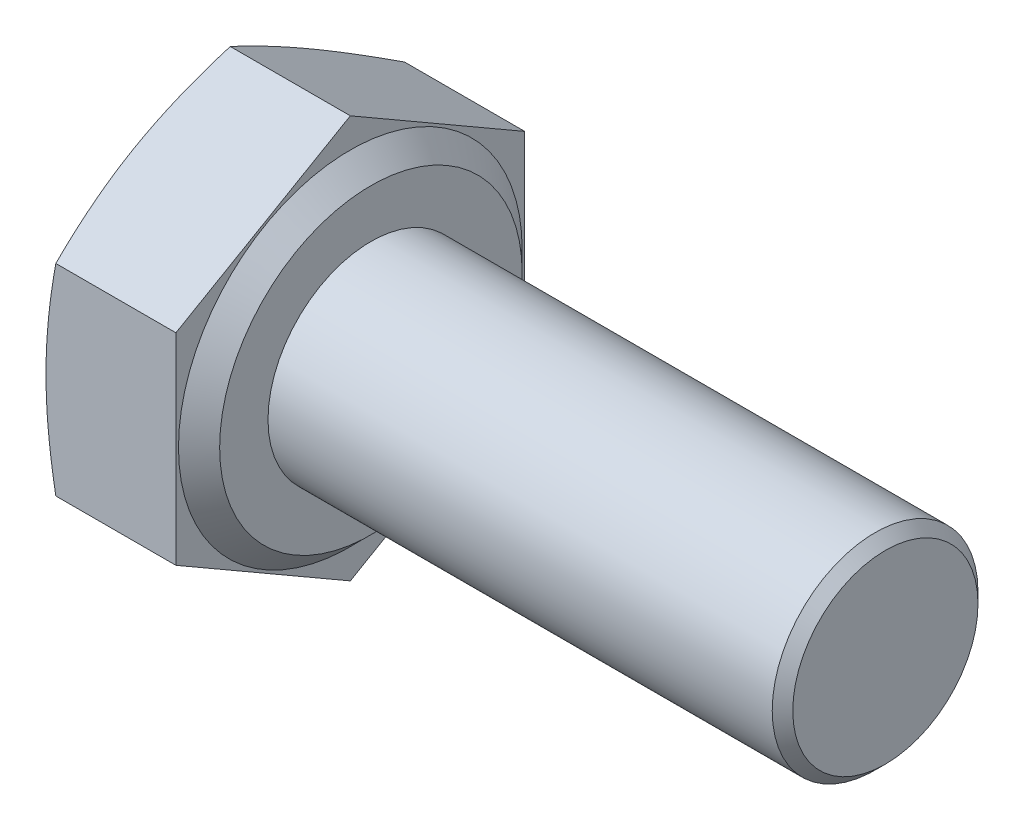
ISO-10303-21;
HEADER;
FILE_DESCRIPTION(('STEP AP214'),'2;1');
FILE_NAME('part.step','',(''),(''),'','','');
FILE_SCHEMA(('AUTOMOTIVE_DESIGN { 1 0 10303 214 1 1 1 1 }'));
ENDSEC;
DATA;
#1=APPLICATION_CONTEXT('core data for automotive mechanical design processes');
#2=APPLICATION_PROTOCOL_DEFINITION('international standard','automotive_design',2000,#1);
#3=PRODUCT_CONTEXT('',#1,'mechanical');
#4=PRODUCT('Part','Part','',(#3));
#5=PRODUCT_RELATED_PRODUCT_CATEGORY('part','',(#4));
#6=PRODUCT_DEFINITION_FORMATION('','',#4);
#7=PRODUCT_DEFINITION_CONTEXT('part definition',#1,'design');
#8=PRODUCT_DEFINITION('design','',#6,#7);
#9=PRODUCT_DEFINITION_SHAPE('','',#8);
#10=(LENGTH_UNIT() NAMED_UNIT(*) SI_UNIT(.MILLI.,.METRE.));
#11=(NAMED_UNIT(*) PLANE_ANGLE_UNIT() SI_UNIT($,.RADIAN.));
#12=(NAMED_UNIT(*) SI_UNIT($,.STERADIAN.) SOLID_ANGLE_UNIT());
#13=UNCERTAINTY_MEASURE_WITH_UNIT(LENGTH_MEASURE(1.E-05),#10,'distance_accuracy_value','');
#14=(GEOMETRIC_REPRESENTATION_CONTEXT(3) GLOBAL_UNCERTAINTY_ASSIGNED_CONTEXT((#13)) GLOBAL_UNIT_ASSIGNED_CONTEXT((#10,
#11,#12)) REPRESENTATION_CONTEXT('',''));
#15=CARTESIAN_POINT('',(0.,0.,0.));
#16=DIRECTION('',(0.,0.,1.));
#17=DIRECTION('',(1.,0.,0.));
#18=AXIS2_PLACEMENT_3D('',#15,#16,#17);
#19=CARTESIAN_POINT('',(2.925,-1.95721741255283,-3.39));
#20=DIRECTION('',(1.,0.,0.));
#21=DIRECTION('',(0.,0.,-1.));
#22=AXIS2_PLACEMENT_3D('',#19,#20,#21);
#23=PLANE('',#22);
#24=CARTESIAN_POINT('',(2.925,0.,0.));
#25=DIRECTION('',(-1.,0.,0.));
#26=DIRECTION('',(0.,0.,1.));
#27=AXIS2_PLACEMENT_3D('',#24,#25,#26);
#28=CIRCLE('',#27,2.94);
#29=CARTESIAN_POINT('',(2.925,0.,2.94));
#30=VERTEX_POINT('',#29);
#31=EDGE_CURVE('E260',#30,#30,#28,.T.);
#32=ORIENTED_EDGE('',*,*,#31,.F.);
#33=EDGE_LOOP('',(#32));
#34=FACE_BOUND('',#33,.T.);
#35=CARTESIAN_POINT('',(2.925,0.,0.));
#36=DIRECTION('',(1.,0.,0.));
#37=DIRECTION('',(0.,0.,-1.));
#38=AXIS2_PLACEMENT_3D('',#35,#36,#37);
#39=CIRCLE('',#38,2.);
#40=CARTESIAN_POINT('',(2.925,0.,-2.));
#41=VERTEX_POINT('',#40);
#42=EDGE_CURVE('E282',#41,#41,#39,.T.);
#43=ORIENTED_EDGE('',*,*,#42,.F.);
#44=EDGE_LOOP('',(#43));
#45=FACE_BOUND('',#44,.T.);
#46=ADVANCED_FACE('F30',(#34,#45),#23,.T.);
#47=CARTESIAN_POINT('',(2.925,-3.91443482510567,0.));
#48=DIRECTION('',(0.,0.866025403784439,0.5));
#49=DIRECTION('',(0.,-0.5,0.866025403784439));
#50=AXIS2_PLACEMENT_3D('',#47,#48,#49);
#51=PLANE('',#50);
#52=CARTESIAN_POINT('',(0.190920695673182,-1.957101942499,-3.3902));
#53=CARTESIAN_POINT('',(0.161404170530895,-2.03816412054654,-3.24979618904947));
#54=CARTESIAN_POINT('',(0.134553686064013,-2.11949362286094,-3.10892935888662));
#55=CARTESIAN_POINT('',(0.0873142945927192,-2.28268148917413,-2.82627968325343));
#56=CARTESIAN_POINT('',(0.0669304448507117,-2.36454021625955,-2.68449620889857));
#57=CARTESIAN_POINT('',(0.0339601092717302,-2.52787800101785,-2.40158686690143));
#58=CARTESIAN_POINT('',(0.0213017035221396,-2.6093533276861,-2.26046746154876));
#59=CARTESIAN_POINT('',(0.00432321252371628,-2.77249453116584,-1.97789860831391));
#60=CARTESIAN_POINT('',(0.,-2.85416032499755,-1.83644930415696));
#61=CARTESIAN_POINT('',(0.,-3.01749191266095,-1.55355069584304));
#62=CARTESIAN_POINT('',(0.00432321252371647,-3.09915770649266,-1.41210139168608));
#63=CARTESIAN_POINT('',(0.0213017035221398,-3.2622989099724,-1.12953253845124));
#64=CARTESIAN_POINT('',(0.0339601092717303,-3.34377423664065,-0.988413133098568));
#65=CARTESIAN_POINT('',(0.066930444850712,-3.50711202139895,-0.705503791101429));
#66=CARTESIAN_POINT('',(0.0873142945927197,-3.58897074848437,-0.563720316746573));
#67=CARTESIAN_POINT('',(0.134553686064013,-3.75215861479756,-0.281070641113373));
#68=CARTESIAN_POINT('',(0.161404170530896,-3.83348811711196,-0.140203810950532));
#69=CARTESIAN_POINT('',(0.190920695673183,-3.9145502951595,0.000200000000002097));
#70=B_SPLINE_CURVE_WITH_KNOTS('',3,(#52,#53,#54,#55,#56,#57,#58,#59,#60,#61,#62,#63,#64,#65,#66,
#67,#68,#69),.UNSPECIFIED.,.F.,.F.,(4,2,2,2,2,2,2,2,4),(0.,0.494419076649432,0.98922386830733,
1.47934907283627,1.96929035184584,2.45923163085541,2.94935683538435,3.44416162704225,
3.93858070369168),.UNSPECIFIED.);
#71=CARTESIAN_POINT('',(0.190878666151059,-1.95721741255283,-3.39));
#72=VERTEX_POINT('',#71);
#73=CARTESIAN_POINT('',(0.,-2.93582611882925,-1.695));
#74=VERTEX_POINT('',#73);
#75=EDGE_CURVE('E108',#72,#74,#70,.T.);
#76=ORIENTED_EDGE('',*,*,#75,.F.);
#77=DIRECTION('',(-1.,0.,0.));
#78=VECTOR('',#77,1.);
#79=CARTESIAN_POINT('',(2.925,-1.95721741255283,-3.39));
#80=LINE('',#79,#78);
#81=CARTESIAN_POINT('',(2.525,-1.95721741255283,-3.39));
#82=VERTEX_POINT('',#81);
#83=EDGE_CURVE('E137',#82,#72,#80,.T.);
#84=ORIENTED_EDGE('',*,*,#83,.F.);
#85=DIRECTION('',(0.,0.5,-0.866025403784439));
#86=VECTOR('',#85,1.);
#87=CARTESIAN_POINT('',(2.525,-3.91443482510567,0.));
#88=LINE('',#87,#86);
#89=CARTESIAN_POINT('',(2.525,-3.91443482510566,0.));
#90=VERTEX_POINT('',#89);
#91=EDGE_CURVE('E273',#90,#82,#88,.T.);
#92=ORIENTED_EDGE('',*,*,#91,.F.);
#93=DIRECTION('',(-1.,0.,0.));
#94=VECTOR('',#93,1.);
#95=CARTESIAN_POINT('',(2.925,-3.91443482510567,0.));
#96=LINE('',#95,#94);
#97=CARTESIAN_POINT('',(0.190878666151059,-3.91443482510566,0.));
#98=VERTEX_POINT('',#97);
#99=EDGE_CURVE('E131',#90,#98,#96,.T.);
#100=ORIENTED_EDGE('',*,*,#99,.T.);
#101=EDGE_CURVE('E161',#74,#98,#70,.T.);
#102=ORIENTED_EDGE('',*,*,#101,.F.);
#103=EDGE_LOOP('',(#76,#84,#92,#100,#102));
#104=FACE_BOUND('',#103,.T.);
#105=ADVANCED_FACE('F176',(#104),#51,.F.);
#106=CARTESIAN_POINT('',(2.925,-1.95721741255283,-3.39));
#107=DIRECTION('',(0.,0.,1.));
#108=DIRECTION('',(0.,-1.,0.));
#109=AXIS2_PLACEMENT_3D('',#106,#107,#108);
#110=PLANE('',#109);
#111=CARTESIAN_POINT('',(1.01998007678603,-5.18202410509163,-3.39));
#112=CARTESIAN_POINT('',(0.973277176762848,-5.02864822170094,-3.39));
#113=CARTESIAN_POINT('',(0.927119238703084,-4.87510331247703,-3.39));
#114=CARTESIAN_POINT('',(0.836194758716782,-4.56758939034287,-3.39));
#115=CARTESIAN_POINT('',(0.791428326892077,-4.41362034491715,-3.39));
#116=CARTESIAN_POINT('',(0.703513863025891,-4.10490856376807,-3.39));
#117=CARTESIAN_POINT('',(0.660369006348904,-3.95016492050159,-3.39));
#118=CARTESIAN_POINT('',(0.576202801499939,-3.64010200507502,-3.39));
#119=CARTESIAN_POINT('',(0.535181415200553,-3.484782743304,-3.39));
#120=CARTESIAN_POINT('',(0.456277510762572,-3.17538445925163,-3.39));
#121=CARTESIAN_POINT('',(0.418362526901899,-3.02131375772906,-3.39));
#122=CARTESIAN_POINT('',(0.345760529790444,-2.71240553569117,-3.39));
#123=CARTESIAN_POINT('',(0.311073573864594,-2.55756800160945,-3.39));
#124=CARTESIAN_POINT('',(0.24573675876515,-2.24709346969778,-3.39));
#125=CARTESIAN_POINT('',(0.215085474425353,-2.09145677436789,-3.39));
#126=CARTESIAN_POINT('',(0.158752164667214,-1.77927622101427,-3.39));
#127=CARTESIAN_POINT('',(0.133070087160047,-1.62273237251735,-3.39));
#128=CARTESIAN_POINT('',(0.0902615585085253,-1.3263632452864,-3.39));
#129=CARTESIAN_POINT('',(0.0724987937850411,-1.186630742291,-3.39));
#130=CARTESIAN_POINT('',(0.0424324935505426,-0.906588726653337,-3.39));
#131=CARTESIAN_POINT('',(0.0301282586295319,-0.766279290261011,-3.39));
#132=CARTESIAN_POINT('',(0.0115684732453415,-0.485347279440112,-3.39));
#133=CARTESIAN_POINT('',(0.00530894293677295,-0.344724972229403,-3.39));
#134=CARTESIAN_POINT('',(-0.00084342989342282,-0.0633396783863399,-3.39));
#135=CARTESIAN_POINT('',(-0.000736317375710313,0.0774233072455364,-3.39));
#136=CARTESIAN_POINT('',(0.00585535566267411,0.359511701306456,-3.39));
#137=CARTESIAN_POINT('',(0.0123722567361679,0.500836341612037,-3.39));
#138=CARTESIAN_POINT('',(0.0314839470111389,0.783070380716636,-3.39));
#139=CARTESIAN_POINT('',(0.0440788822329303,0.923979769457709,-3.39));
#140=CARTESIAN_POINT('',(0.0747561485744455,1.20531436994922,-3.39));
#141=CARTESIAN_POINT('',(0.0928431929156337,1.34573906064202,-3.39));
#142=CARTESIAN_POINT('',(0.133775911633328,1.62588403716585,-3.39));
#143=CARTESIAN_POINT('',(0.156621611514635,1.76560431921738,-3.39));
#144=CARTESIAN_POINT('',(0.233780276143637,2.19842514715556,-3.39));
#145=CARTESIAN_POINT('',(0.294955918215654,2.4902988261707,-3.39));
#146=CARTESIAN_POINT('',(0.429080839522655,3.07133562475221,-3.39));
#147=CARTESIAN_POINT('',(0.502034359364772,3.36049772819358,-3.39));
#148=CARTESIAN_POINT('',(0.65579023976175,3.93710818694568,-3.39));
#149=CARTESIAN_POINT('',(0.736602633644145,4.22455384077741,-3.39));
#150=CARTESIAN_POINT('',(0.90342621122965,4.79786777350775,-3.39));
#151=CARTESIAN_POINT('',(0.989436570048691,5.0837362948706,-3.39));
#152=CARTESIAN_POINT('',(1.16408502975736,5.65121198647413,-3.39));
#153=CARTESIAN_POINT('',(1.25268364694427,5.93283136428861,-3.39));
#154=CARTESIAN_POINT('',(1.43239750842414,6.49527820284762,-3.39));
#155=CARTESIAN_POINT('',(1.52351287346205,6.77610562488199,-3.39));
#156=CARTESIAN_POINT('',(1.70722880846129,7.33609271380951,-3.39));
#157=CARTESIAN_POINT('',(1.7998224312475,7.61525466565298,-3.39));
#158=CARTESIAN_POINT('',(1.98639796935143,8.17308908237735,-3.39));
#159=CARTESIAN_POINT('',(2.08037976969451,8.45176158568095,-3.39));
#160=CARTESIAN_POINT('',(2.17484722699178,8.73026698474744,-3.39));
#161=B_SPLINE_CURVE_WITH_KNOTS('',3,(#111,#112,#113,#114,#115,#116,#117,#118,#119,#120,#121,
#122,#123,#124,#125,#126,#127,#128,#129,#130,#131,#132,#133,#134,#135,#136,#137,#138,#139,#140,
#141,#142,#143,#144,#145,#146,#147,#148,#149,#150,#151,#152,#153,#154,#155,#156,#157,#158,#159,
#160),.UNSPECIFIED.,.F.,.F.,(4,2,2,2,2,2,2,2,2,2,2,2,2,2,2,2,2,2,2,2,2,2,2,2,4),(0.,
0.480989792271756,0.962017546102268,1.44394277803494,1.92585935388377,2.40183391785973,
2.87781693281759,3.35363140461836,3.82944088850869,4.25191903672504,4.6743430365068,
5.09648872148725,5.5186314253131,5.94291503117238,6.36720883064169,6.79186778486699,
7.2165290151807,8.11074158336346,9.00527683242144,9.90096950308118,10.7965204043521,
11.6821863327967,12.5678948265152,13.4502426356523,14.3325177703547),.UNSPECIFIED.);
#162=CARTESIAN_POINT('',(0.190878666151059,1.95721741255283,-3.39));
#163=VERTEX_POINT('',#162);
#164=CARTESIAN_POINT('',(0.,0.,-3.39));
#165=VERTEX_POINT('',#164);
#166=EDGE_CURVE('E221',#163,#165,#161,.F.);
#167=ORIENTED_EDGE('',*,*,#166,.F.);
#168=DIRECTION('',(-1.,0.,0.));
#169=VECTOR('',#168,1.);
#170=CARTESIAN_POINT('',(2.925,1.95721741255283,-3.39));
#171=LINE('',#170,#169);
#172=CARTESIAN_POINT('',(2.525,1.95721741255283,-3.39));
#173=VERTEX_POINT('',#172);
#174=EDGE_CURVE('E128',#173,#163,#171,.T.);
#175=ORIENTED_EDGE('',*,*,#174,.F.);
#176=DIRECTION('',(0.,1.,0.));
#177=VECTOR('',#176,1.);
#178=CARTESIAN_POINT('',(2.525,-1.95721741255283,-3.39));
#179=LINE('',#178,#177);
#180=EDGE_CURVE('E271',#82,#173,#179,.T.);
#181=ORIENTED_EDGE('',*,*,#180,.F.);
#182=ORIENTED_EDGE('',*,*,#83,.T.);
#183=EDGE_CURVE('E119',#165,#72,#161,.F.);
#184=ORIENTED_EDGE('',*,*,#183,.F.);
#185=EDGE_LOOP('',(#167,#175,#181,#182,#184));
#186=FACE_BOUND('',#185,.T.);
#187=ADVANCED_FACE('F228',(#186),#110,.F.);
#188=CARTESIAN_POINT('',(2.925,1.95721741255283,-3.39));
#189=DIRECTION('',(0.,-0.866025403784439,0.5));
#190=DIRECTION('',(0.,-0.5,-0.866025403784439));
#191=AXIS2_PLACEMENT_3D('',#188,#189,#190);
#192=PLANE('',#191);
#193=CARTESIAN_POINT('',(0.190920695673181,3.9145502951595,0.000199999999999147));
#194=CARTESIAN_POINT('',(0.161404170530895,3.83348811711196,-0.140203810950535));
#195=CARTESIAN_POINT('',(0.134553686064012,3.75215861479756,-0.281070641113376));
#196=CARTESIAN_POINT('',(0.0873142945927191,3.58897074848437,-0.563720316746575));
#197=CARTESIAN_POINT('',(0.0669304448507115,3.50711202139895,-0.705503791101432));
#198=CARTESIAN_POINT('',(0.0339601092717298,3.34377423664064,-0.988413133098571));
#199=CARTESIAN_POINT('',(0.0213017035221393,3.2622989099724,-1.12953253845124));
#200=CARTESIAN_POINT('',(0.004323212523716,3.09915770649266,-1.41210139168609));
#201=CARTESIAN_POINT('',(0.,3.01749191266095,-1.55355069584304));
#202=CARTESIAN_POINT('',(0.,2.85416032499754,-1.83644930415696));
#203=CARTESIAN_POINT('',(0.00432321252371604,2.77249453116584,-1.97789860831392));
#204=CARTESIAN_POINT('',(0.0213017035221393,2.6093533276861,-2.26046746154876));
#205=CARTESIAN_POINT('',(0.0339601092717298,2.52787800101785,-2.40158686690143));
#206=CARTESIAN_POINT('',(0.0669304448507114,2.36454021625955,-2.68449620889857));
#207=CARTESIAN_POINT('',(0.087314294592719,2.28268148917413,-2.82627968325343));
#208=CARTESIAN_POINT('',(0.134553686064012,2.11949362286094,-3.10892935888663));
#209=CARTESIAN_POINT('',(0.161404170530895,2.03816412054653,-3.24979618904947));
#210=CARTESIAN_POINT('',(0.190920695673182,1.95710194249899,-3.3902));
#211=B_SPLINE_CURVE_WITH_KNOTS('',3,(#193,#194,#195,#196,#197,#198,#199,#200,#201,#202,#203,
#204,#205,#206,#207,#208,#209,#210),.UNSPECIFIED.,.F.,.F.,(4,2,2,2,2,2,2,2,4),(0.,
0.494419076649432,0.989223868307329,1.47934907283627,1.96929035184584,2.45923163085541,
2.94935683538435,3.44416162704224,3.93858070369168),.UNSPECIFIED.);
#212=CARTESIAN_POINT('',(0.190878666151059,3.91443482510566,0.));
#213=VERTEX_POINT('',#212);
#214=CARTESIAN_POINT('',(0.,2.93582611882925,-1.695));
#215=VERTEX_POINT('',#214);
#216=EDGE_CURVE('E45',#213,#215,#211,.T.);
#217=ORIENTED_EDGE('',*,*,#216,.F.);
#218=DIRECTION('',(-1.,0.,0.));
#219=VECTOR('',#218,1.);
#220=CARTESIAN_POINT('',(2.925,3.91443482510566,0.));
#221=LINE('',#220,#219);
#222=CARTESIAN_POINT('',(2.525,3.91443482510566,0.));
#223=VERTEX_POINT('',#222);
#224=EDGE_CURVE('E125',#223,#213,#221,.T.);
#225=ORIENTED_EDGE('',*,*,#224,.F.);
#226=DIRECTION('',(0.,0.5,0.866025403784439));
#227=VECTOR('',#226,1.);
#228=CARTESIAN_POINT('',(2.525,1.95721741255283,-3.39));
#229=LINE('',#228,#227);
#230=EDGE_CURVE('E269',#173,#223,#229,.T.);
#231=ORIENTED_EDGE('',*,*,#230,.F.);
#232=ORIENTED_EDGE('',*,*,#174,.T.);
#233=EDGE_CURVE('E222',#215,#163,#211,.T.);
#234=ORIENTED_EDGE('',*,*,#233,.F.);
#235=EDGE_LOOP('',(#217,#225,#231,#232,#234));
#236=FACE_BOUND('',#235,.T.);
#237=ADVANCED_FACE('F231',(#236),#192,.F.);
#238=CARTESIAN_POINT('',(2.925,3.91443482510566,0.));
#239=DIRECTION('',(0.,-0.866025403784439,-0.5));
#240=DIRECTION('',(0.,0.5,-0.866025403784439));
#241=AXIS2_PLACEMENT_3D('',#238,#239,#240);
#242=PLANE('',#241);
#243=CARTESIAN_POINT('',(0.190920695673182,1.95710194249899,3.3902));
#244=CARTESIAN_POINT('',(0.161404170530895,2.03816412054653,3.24979618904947));
#245=CARTESIAN_POINT('',(0.134553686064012,2.11949362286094,3.10892935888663));
#246=CARTESIAN_POINT('',(0.0873142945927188,2.28268148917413,2.82627968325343));
#247=CARTESIAN_POINT('',(0.0669304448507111,2.36454021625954,2.68449620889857));
#248=CARTESIAN_POINT('',(0.0339601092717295,2.52787800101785,2.40158686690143));
#249=CARTESIAN_POINT('',(0.0213017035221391,2.6093533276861,2.26046746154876));
#250=CARTESIAN_POINT('',(0.00432321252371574,2.77249453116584,1.97789860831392));
#251=CARTESIAN_POINT('',(0.,2.85416032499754,1.83644930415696));
#252=CARTESIAN_POINT('',(0.,3.01749191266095,1.55355069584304));
#253=CARTESIAN_POINT('',(0.00432321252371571,3.09915770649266,1.41210139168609));
#254=CARTESIAN_POINT('',(0.0213017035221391,3.2622989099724,1.12953253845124));
#255=CARTESIAN_POINT('',(0.0339601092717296,3.34377423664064,0.98841313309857));
#256=CARTESIAN_POINT('',(0.0669304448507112,3.50711202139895,0.705503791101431));
#257=CARTESIAN_POINT('',(0.0873142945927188,3.58897074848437,0.563720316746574));
#258=CARTESIAN_POINT('',(0.134553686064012,3.75215861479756,0.281070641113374));
#259=CARTESIAN_POINT('',(0.161404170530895,3.83348811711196,0.140203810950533));
#260=CARTESIAN_POINT('',(0.190920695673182,3.9145502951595,-0.000200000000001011));
#261=B_SPLINE_CURVE_WITH_KNOTS('',3,(#243,#244,#245,#246,#247,#248,#249,#250,#251,#252,#253,
#254,#255,#256,#257,#258,#259,#260),.UNSPECIFIED.,.F.,.F.,(4,2,2,2,2,2,2,2,4),(0.,
0.494419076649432,0.98922386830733,1.47934907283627,1.96929035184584,2.45923163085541,
2.94935683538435,3.44416162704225,3.93858070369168),.UNSPECIFIED.);
#262=CARTESIAN_POINT('',(0.190878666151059,1.95721741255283,3.39));
#263=VERTEX_POINT('',#262);
#264=CARTESIAN_POINT('',(0.,2.93582611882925,1.695));
#265=VERTEX_POINT('',#264);
#266=EDGE_CURVE('E53',#263,#265,#261,.T.);
#267=ORIENTED_EDGE('',*,*,#266,.F.);
#268=DIRECTION('',(-1.,0.,0.));
#269=VECTOR('',#268,1.);
#270=CARTESIAN_POINT('',(2.925,1.95721741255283,3.39));
#271=LINE('',#270,#269);
#272=CARTESIAN_POINT('',(2.525,1.95721741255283,3.39));
#273=VERTEX_POINT('',#272);
#274=EDGE_CURVE('E116',#273,#263,#271,.T.);
#275=ORIENTED_EDGE('',*,*,#274,.F.);
#276=DIRECTION('',(0.,-0.5,0.866025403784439));
#277=VECTOR('',#276,1.);
#278=CARTESIAN_POINT('',(2.525,3.91443482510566,0.));
#279=LINE('',#278,#277);
#280=EDGE_CURVE('E267',#223,#273,#279,.T.);
#281=ORIENTED_EDGE('',*,*,#280,.F.);
#282=ORIENTED_EDGE('',*,*,#224,.T.);
#283=EDGE_CURVE('E118',#265,#213,#261,.T.);
#284=ORIENTED_EDGE('',*,*,#283,.F.);
#285=EDGE_LOOP('',(#267,#275,#281,#282,#284));
#286=FACE_BOUND('',#285,.T.);
#287=ADVANCED_FACE('F114',(#286),#242,.F.);
#288=CARTESIAN_POINT('',(2.925,1.95721741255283,3.39));
#289=DIRECTION('',(0.,0.,-1.));
#290=DIRECTION('',(-1.,0.,0.));
#291=AXIS2_PLACEMENT_3D('',#288,#289,#290);
#292=PLANE('',#291);
#293=CARTESIAN_POINT('',(1.01997989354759,-5.18202350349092,3.39));
#294=CARTESIAN_POINT('',(0.973277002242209,-5.02864764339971,3.39));
#295=CARTESIAN_POINT('',(0.927119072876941,-4.87510275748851,3.39));
#296=CARTESIAN_POINT('',(0.8361946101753,-4.56758888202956,3.39));
#297=CARTESIAN_POINT('',(0.791428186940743,-4.41361985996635,3.39));
#298=CARTESIAN_POINT('',(0.703513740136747,-4.1049081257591,3.39));
#299=CARTESIAN_POINT('',(0.660368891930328,-3.9501645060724,3.39));
#300=CARTESIAN_POINT('',(0.576202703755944,-3.64010163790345,3.39));
#301=CARTESIAN_POINT('',(0.535181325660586,-3.48478239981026,3.39));
#302=CARTESIAN_POINT('',(0.456277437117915,-3.17538416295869,3.39));
#303=CARTESIAN_POINT('',(0.418362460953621,-3.02131348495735,3.39));
#304=CARTESIAN_POINT('',(0.345760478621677,-2.71240531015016,3.39));
#305=CARTESIAN_POINT('',(0.311073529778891,-2.55756779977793,3.39));
#306=CARTESIAN_POINT('',(0.245736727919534,-2.24709331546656,3.39));
#307=CARTESIAN_POINT('',(0.21508544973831,-2.09145664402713,3.39));
#308=CARTESIAN_POINT('',(0.158752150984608,-1.7792761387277,3.39));
#309=CARTESIAN_POINT('',(0.133070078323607,-1.62273231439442,3.39));
#310=CARTESIAN_POINT('',(0.0902615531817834,-1.32636320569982,3.39));
#311=CARTESIAN_POINT('',(0.0724987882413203,-1.18663069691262,3.39));
#312=CARTESIAN_POINT('',(0.0424324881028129,-0.906588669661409,3.39));
#313=CARTESIAN_POINT('',(0.0301282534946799,-0.766279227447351,3.39));
#314=CARTESIAN_POINT('',(0.0115684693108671,-0.485347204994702,3.39));
#315=CARTESIAN_POINT('',(0.00530893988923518,-0.344724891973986,3.39));
#316=CARTESIAN_POINT('',(-0.000843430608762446,-0.0633395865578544,3.39));
#317=CARTESIAN_POINT('',(-0.000736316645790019,0.077423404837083,3.39));
#318=CARTESIAN_POINT('',(0.00585535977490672,0.359511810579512,3.39));
#319=CARTESIAN_POINT('',(0.0123722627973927,0.500836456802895,3.39));
#320=CARTESIAN_POINT('',(0.0314839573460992,0.783070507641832,3.39));
#321=CARTESIAN_POINT('',(0.0440788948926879,0.923979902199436,3.39));
#322=CARTESIAN_POINT('',(0.0747561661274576,1.2053145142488,3.39));
#323=CARTESIAN_POINT('',(0.0928432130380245,1.34573921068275,3.39));
#324=CARTESIAN_POINT('',(0.133775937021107,1.62588419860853,3.39));
#325=CARTESIAN_POINT('',(0.156621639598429,1.76560448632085,3.39));
#326=CARTESIAN_POINT('',(0.233780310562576,2.19842531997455,3.39));
#327=CARTESIAN_POINT('',(0.2949559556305,2.49029899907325,3.39));
#328=CARTESIAN_POINT('',(0.429080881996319,3.07133579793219,3.39));
#329=CARTESIAN_POINT('',(0.502034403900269,3.36049790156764,3.39));
#330=CARTESIAN_POINT('',(0.655790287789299,3.93710836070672,3.39));
#331=CARTESIAN_POINT('',(0.736602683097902,4.22455401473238,3.39));
#332=CARTESIAN_POINT('',(0.903426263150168,4.79786794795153,3.39));
#333=CARTESIAN_POINT('',(0.989436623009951,5.08373646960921,3.39));
#334=CARTESIAN_POINT('',(1.16408508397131,5.65121216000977,3.39));
#335=CARTESIAN_POINT('',(1.25268370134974,5.93283153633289,3.39));
#336=CARTESIAN_POINT('',(1.43239756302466,6.49527837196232,3.39));
#337=CARTESIAN_POINT('',(1.52351292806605,6.77610579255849,3.39));
#338=CARTESIAN_POINT('',(1.70722886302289,7.3360928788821,3.39));
#339=CARTESIAN_POINT('',(1.79982248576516,7.61525482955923,3.39));
#340=CARTESIAN_POINT('',(1.98639802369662,8.17308924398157,3.39));
#341=CARTESIAN_POINT('',(2.08037982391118,8.45176174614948,3.39));
#342=CARTESIAN_POINT('',(2.17484728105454,8.73026714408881,3.39));
#343=B_SPLINE_CURVE_WITH_KNOTS('',3,(#293,#294,#295,#296,#297,#298,#299,#300,#301,#302,#303,
#304,#305,#306,#307,#308,#309,#310,#311,#312,#313,#314,#315,#316,#317,#318,#319,#320,#321,#322,
#323,#324,#325,#326,#327,#328,#329,#330,#331,#332,#333,#334,#335,#336,#337,#338,#339,#340,#341,
#342),.UNSPECIFIED.,.F.,.F.,(4,2,2,2,2,2,2,2,2,2,2,2,2,2,2,2,2,2,2,2,2,2,2,2,4),(0.,
0.480989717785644,0.96201739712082,1.44394255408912,1.92585905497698,2.40183354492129,
2.87781648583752,3.35363088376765,3.82944029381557,4.25191845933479,4.67434247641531,
5.09648817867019,5.51863089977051,5.94291452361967,6.36720834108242,6.79186731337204,
7.21652856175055,8.11074113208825,9.00527638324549,9.90096905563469,10.7965199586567,
11.6821858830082,12.5678943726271,13.4502421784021,14.3325173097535),.UNSPECIFIED.);
#344=CARTESIAN_POINT('',(0.190878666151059,-1.95721741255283,3.39));
#345=VERTEX_POINT('',#344);
#346=CARTESIAN_POINT('',(0.,0.,3.39));
#347=VERTEX_POINT('',#346);
#348=EDGE_CURVE('E110',#345,#347,#343,.T.);
#349=ORIENTED_EDGE('',*,*,#348,.F.);
#350=DIRECTION('',(-1.,0.,0.));
#351=VECTOR('',#350,1.);
#352=CARTESIAN_POINT('',(2.925,-1.95721741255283,3.39));
#353=LINE('',#352,#351);
#354=CARTESIAN_POINT('',(2.525,-1.95721741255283,3.39));
#355=VERTEX_POINT('',#354);
#356=EDGE_CURVE('E126',#355,#345,#353,.T.);
#357=ORIENTED_EDGE('',*,*,#356,.F.);
#358=DIRECTION('',(0.,-1.,0.));
#359=VECTOR('',#358,1.);
#360=CARTESIAN_POINT('',(2.525,1.95721741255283,3.39));
#361=LINE('',#360,#359);
#362=EDGE_CURVE('E124',#273,#355,#361,.T.);
#363=ORIENTED_EDGE('',*,*,#362,.F.);
#364=ORIENTED_EDGE('',*,*,#274,.T.);
#365=EDGE_CURVE('E100',#347,#263,#343,.T.);
#366=ORIENTED_EDGE('',*,*,#365,.F.);
#367=EDGE_LOOP('',(#349,#357,#363,#364,#366));
#368=FACE_BOUND('',#367,.T.);
#369=ADVANCED_FACE('F122',(#368),#292,.F.);
#370=CARTESIAN_POINT('',(2.925,-1.95721741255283,3.39));
#371=DIRECTION('',(0.,0.866025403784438,-0.5));
#372=DIRECTION('',(0.,0.5,0.866025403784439));
#373=AXIS2_PLACEMENT_3D('',#370,#371,#372);
#374=PLANE('',#373);
#375=CARTESIAN_POINT('',(0.190920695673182,-3.9145502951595,-0.000199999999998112));
#376=CARTESIAN_POINT('',(0.161404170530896,-3.83348811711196,0.140203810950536));
#377=CARTESIAN_POINT('',(0.134553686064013,-3.75215861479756,0.281070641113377));
#378=CARTESIAN_POINT('',(0.0873142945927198,-3.58897074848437,0.563720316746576));
#379=CARTESIAN_POINT('',(0.0669304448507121,-3.50711202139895,0.705503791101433));
#380=CARTESIAN_POINT('',(0.0339601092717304,-3.34377423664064,0.988413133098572));
#381=CARTESIAN_POINT('',(0.02130170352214,-3.2622989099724,1.12953253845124));
#382=CARTESIAN_POINT('',(0.00432321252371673,-3.09915770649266,1.41210139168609));
#383=CARTESIAN_POINT('',(0.,-3.01749191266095,1.55355069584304));
#384=CARTESIAN_POINT('',(0.,-2.85416032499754,1.83644930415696));
#385=CARTESIAN_POINT('',(0.00432321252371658,-2.77249453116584,1.97789860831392));
#386=CARTESIAN_POINT('',(0.0213017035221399,-2.6093533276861,2.26046746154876));
#387=CARTESIAN_POINT('',(0.0339601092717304,-2.52787800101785,2.40158686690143));
#388=CARTESIAN_POINT('',(0.066930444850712,-2.36454021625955,2.68449620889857));
#389=CARTESIAN_POINT('',(0.0873142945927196,-2.28268148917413,2.82627968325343));
#390=CARTESIAN_POINT('',(0.134553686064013,-2.11949362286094,3.10892935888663));
#391=CARTESIAN_POINT('',(0.161404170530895,-2.03816412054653,3.24979618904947));
#392=CARTESIAN_POINT('',(0.190920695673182,-1.95710194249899,3.3902));
#393=B_SPLINE_CURVE_WITH_KNOTS('',3,(#375,#376,#377,#378,#379,#380,#381,#382,#383,#384,#385,
#386,#387,#388,#389,#390,#391,#392),.UNSPECIFIED.,.F.,.F.,(4,2,2,2,2,2,2,2,4),(0.,
0.494419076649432,0.989223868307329,1.47934907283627,1.96929035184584,2.45923163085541,
2.94935683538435,3.44416162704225,3.93858070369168),.UNSPECIFIED.);
#394=CARTESIAN_POINT('',(0.,-2.93582611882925,1.695));
#395=VERTEX_POINT('',#394);
#396=EDGE_CURVE('E163',#98,#395,#393,.T.);
#397=ORIENTED_EDGE('',*,*,#396,.F.);
#398=ORIENTED_EDGE('',*,*,#99,.F.);
#399=DIRECTION('',(0.,-0.5,-0.866025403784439));
#400=VECTOR('',#399,1.);
#401=CARTESIAN_POINT('',(2.525,-1.95721741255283,3.39));
#402=LINE('',#401,#400);
#403=EDGE_CURVE('E140',#355,#90,#402,.T.);
#404=ORIENTED_EDGE('',*,*,#403,.F.);
#405=ORIENTED_EDGE('',*,*,#356,.T.);
#406=EDGE_CURVE('E208',#395,#345,#393,.T.);
#407=ORIENTED_EDGE('',*,*,#406,.F.);
#408=EDGE_LOOP('',(#397,#398,#404,#405,#407));
#409=FACE_BOUND('',#408,.T.);
#410=ADVANCED_FACE('F240',(#409),#374,.F.);
#411=CARTESIAN_POINT('',(2.525,3.34,0.));
#412=DIRECTION('',(1.,0.,0.));
#413=DIRECTION('',(0.,0.,-1.));
#414=AXIS2_PLACEMENT_3D('',#411,#412,#413);
#415=PLANE('',#414);
#416=CARTESIAN_POINT('',(2.525,0.,0.));
#417=DIRECTION('',(-1.,0.,0.));
#418=DIRECTION('',(0.,0.,1.));
#419=AXIS2_PLACEMENT_3D('',#416,#417,#418);
#420=CIRCLE('',#419,3.34);
#421=CARTESIAN_POINT('',(2.525,0.,3.34));
#422=VERTEX_POINT('',#421);
#423=EDGE_CURVE('E263',#422,#422,#420,.T.);
#424=ORIENTED_EDGE('',*,*,#423,.T.);
#425=EDGE_LOOP('',(#424));
#426=FACE_BOUND('',#425,.T.);
#427=ORIENTED_EDGE('',*,*,#91,.T.);
#428=ORIENTED_EDGE('',*,*,#180,.T.);
#429=ORIENTED_EDGE('',*,*,#230,.T.);
#430=ORIENTED_EDGE('',*,*,#280,.T.);
#431=ORIENTED_EDGE('',*,*,#362,.T.);
#432=ORIENTED_EDGE('',*,*,#403,.T.);
#433=EDGE_LOOP('',(#427,#428,#429,#430,#431,#432));
#434=FACE_BOUND('',#433,.T.);
#435=ADVANCED_FACE('F204',(#426,#434),#415,.T.);
#436=CARTESIAN_POINT('',(2.525,0.,0.));
#437=DIRECTION('',(-1.,0.,0.));
#438=DIRECTION('',(0.,0.,1.));
#439=AXIS2_PLACEMENT_3D('',#436,#437,#438);
#440=CONICAL_SURFACE('',#439,3.34,0.785398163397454);
#441=ORIENTED_EDGE('',*,*,#31,.T.);
#442=EDGE_LOOP('',(#441));
#443=FACE_BOUND('',#442,.T.);
#444=ORIENTED_EDGE('',*,*,#423,.F.);
#445=EDGE_LOOP('',(#444));
#446=FACE_BOUND('',#445,.T.);
#447=ADVANCED_FACE('F249',(#443,#446),#440,.T.);
#448=CARTESIAN_POINT('',(0.,0.,0.));
#449=DIRECTION('',(1.,0.,0.));
#450=DIRECTION('',(0.,0.,-1.));
#451=AXIS2_PLACEMENT_3D('',#448,#449,#450);
#452=CONICAL_SURFACE('',#451,3.39,1.22173047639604);
#453=ORIENTED_EDGE('',*,*,#183,.T.);
#454=ORIENTED_EDGE('',*,*,#75,.T.);
#455=CARTESIAN_POINT('',(0.,0.,0.));
#456=DIRECTION('',(1.,0.,0.));
#457=DIRECTION('',(0.,0.,-1.));
#458=AXIS2_PLACEMENT_3D('',#455,#456,#457);
#459=CIRCLE('',#458,3.39);
#460=EDGE_CURVE('E142',#74,#165,#459,.T.);
#461=ORIENTED_EDGE('',*,*,#460,.T.);
#462=EDGE_LOOP('',(#453,#454,#461));
#463=FACE_BOUND('',#462,.T.);
#464=ADVANCED_FACE('F169',(#463),#452,.T.);
#465=ORIENTED_EDGE('',*,*,#101,.T.);
#466=ORIENTED_EDGE('',*,*,#396,.T.);
#467=EDGE_CURVE('E144',#395,#74,#459,.T.);
#468=ORIENTED_EDGE('',*,*,#467,.T.);
#469=EDGE_LOOP('',(#465,#466,#468));
#470=FACE_BOUND('',#469,.T.);
#471=ADVANCED_FACE('F159',(#470),#452,.T.);
#472=ORIENTED_EDGE('',*,*,#348,.T.);
#473=EDGE_CURVE('E153',#347,#395,#459,.T.);
#474=ORIENTED_EDGE('',*,*,#473,.T.);
#475=ORIENTED_EDGE('',*,*,#406,.T.);
#476=EDGE_LOOP('',(#472,#474,#475));
#477=FACE_BOUND('',#476,.T.);
#478=ADVANCED_FACE('F201',(#477),#452,.T.);
#479=ORIENTED_EDGE('',*,*,#266,.T.);
#480=CARTESIAN_POINT('',(0.,0.,0.));
#481=DIRECTION('',(-1.,0.,0.));
#482=DIRECTION('',(0.,0.,1.));
#483=AXIS2_PLACEMENT_3D('',#480,#481,#482);
#484=CIRCLE('',#483,3.39);
#485=EDGE_CURVE('E103',#347,#265,#484,.T.);
#486=ORIENTED_EDGE('',*,*,#485,.F.);
#487=ORIENTED_EDGE('',*,*,#365,.T.);
#488=EDGE_LOOP('',(#479,#486,#487));
#489=FACE_BOUND('',#488,.T.);
#490=ADVANCED_FACE('F101',(#489),#452,.T.);
#491=ORIENTED_EDGE('',*,*,#216,.T.);
#492=EDGE_CURVE('E149',#215,#265,#459,.T.);
#493=ORIENTED_EDGE('',*,*,#492,.T.);
#494=ORIENTED_EDGE('',*,*,#283,.T.);
#495=EDGE_LOOP('',(#491,#493,#494));
#496=FACE_BOUND('',#495,.T.);
#497=ADVANCED_FACE('F195',(#496),#452,.T.);
#498=ORIENTED_EDGE('',*,*,#233,.T.);
#499=ORIENTED_EDGE('',*,*,#166,.T.);
#500=EDGE_CURVE('E145',#165,#215,#459,.T.);
#501=ORIENTED_EDGE('',*,*,#500,.T.);
#502=EDGE_LOOP('',(#498,#499,#501));
#503=FACE_BOUND('',#502,.T.);
#504=ADVANCED_FACE('F200',(#503),#452,.T.);
#505=CARTESIAN_POINT('',(0.,-1.95721741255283,-3.39));
#506=DIRECTION('',(1.,0.,0.));
#507=DIRECTION('',(0.,0.,-1.));
#508=AXIS2_PLACEMENT_3D('',#505,#506,#507);
#509=PLANE('',#508);
#510=ORIENTED_EDGE('',*,*,#500,.F.);
#511=ORIENTED_EDGE('',*,*,#460,.F.);
#512=ORIENTED_EDGE('',*,*,#467,.F.);
#513=ORIENTED_EDGE('',*,*,#473,.F.);
#514=ORIENTED_EDGE('',*,*,#485,.T.);
#515=ORIENTED_EDGE('',*,*,#492,.F.);
#516=EDGE_LOOP('',(#510,#511,#512,#513,#514,#515));
#517=FACE_BOUND('',#516,.T.);
#518=ADVANCED_FACE('F174',(#517),#509,.F.);
#519=CARTESIAN_POINT('',(12.925,0.,0.));
#520=DIRECTION('',(-1.,0.,0.));
#521=DIRECTION('',(0.,0.,1.));
#522=AXIS2_PLACEMENT_3D('',#519,#520,#521);
#523=CYLINDRICAL_SURFACE('',#522,2.);
#524=CARTESIAN_POINT('',(12.725,0.,0.));
#525=DIRECTION('',(1.,0.,0.));
#526=DIRECTION('',(0.,0.,-1.));
#527=AXIS2_PLACEMENT_3D('',#524,#525,#526);
#528=CIRCLE('',#527,2.);
#529=CARTESIAN_POINT('',(12.725,0.,-2.));
#530=VERTEX_POINT('',#529);
#531=EDGE_CURVE('E11',#530,#530,#528,.F.);
#532=ORIENTED_EDGE('',*,*,#531,.T.);
#533=EDGE_LOOP('',(#532));
#534=FACE_BOUND('',#533,.T.);
#535=ORIENTED_EDGE('',*,*,#42,.T.);
#536=EDGE_LOOP('',(#535));
#537=FACE_BOUND('',#536,.T.);
#538=ADVANCED_FACE('F202',(#534,#537),#523,.T.);
#539=CARTESIAN_POINT('',(12.925,0.,0.));
#540=DIRECTION('',(1.,0.,0.));
#541=DIRECTION('',(0.,0.,-1.));
#542=AXIS2_PLACEMENT_3D('',#539,#540,#541);
#543=PLANE('',#542);
#544=CARTESIAN_POINT('',(12.925,0.,0.));
#545=DIRECTION('',(1.,0.,0.));
#546=DIRECTION('',(0.,0.,-1.));
#547=AXIS2_PLACEMENT_3D('',#544,#545,#546);
#548=CIRCLE('',#547,1.8);
#549=CARTESIAN_POINT('',(12.925,0.,-1.8));
#550=VERTEX_POINT('',#549);
#551=EDGE_CURVE('E38',#550,#550,#548,.T.);
#552=ORIENTED_EDGE('',*,*,#551,.T.);
#553=EDGE_LOOP('',(#552));
#554=FACE_BOUND('',#553,.T.);
#555=ADVANCED_FACE('F289',(#554),#543,.T.);
#556=CARTESIAN_POINT('',(12.925,0.,0.));
#557=DIRECTION('',(-1.,0.,0.));
#558=DIRECTION('',(0.,0.,1.));
#559=AXIS2_PLACEMENT_3D('',#556,#557,#558);
#560=CONICAL_SURFACE('',#559,1.8,0.785398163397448);
#561=ORIENTED_EDGE('',*,*,#531,.F.);
#562=EDGE_LOOP('',(#561));
#563=FACE_BOUND('',#562,.T.);
#564=ORIENTED_EDGE('',*,*,#551,.F.);
#565=EDGE_LOOP('',(#564));
#566=FACE_BOUND('',#565,.T.);
#567=ADVANCED_FACE('F32',(#563,#566),#560,.T.);
#568=CLOSED_SHELL('',(#46,#105,#187,#237,#287,#369,#410,#435,#447,#464,#471,#478,#490,#497,#504,
#518,#538,#555,#567));
#569=MANIFOLD_SOLID_BREP('B2',#568);
#570=ADVANCED_BREP_SHAPE_REPRESENTATION('',(#18,#569),#14);
#571=SHAPE_DEFINITION_REPRESENTATION(#9,#570);
ENDSEC;
END-ISO-10303-21;
